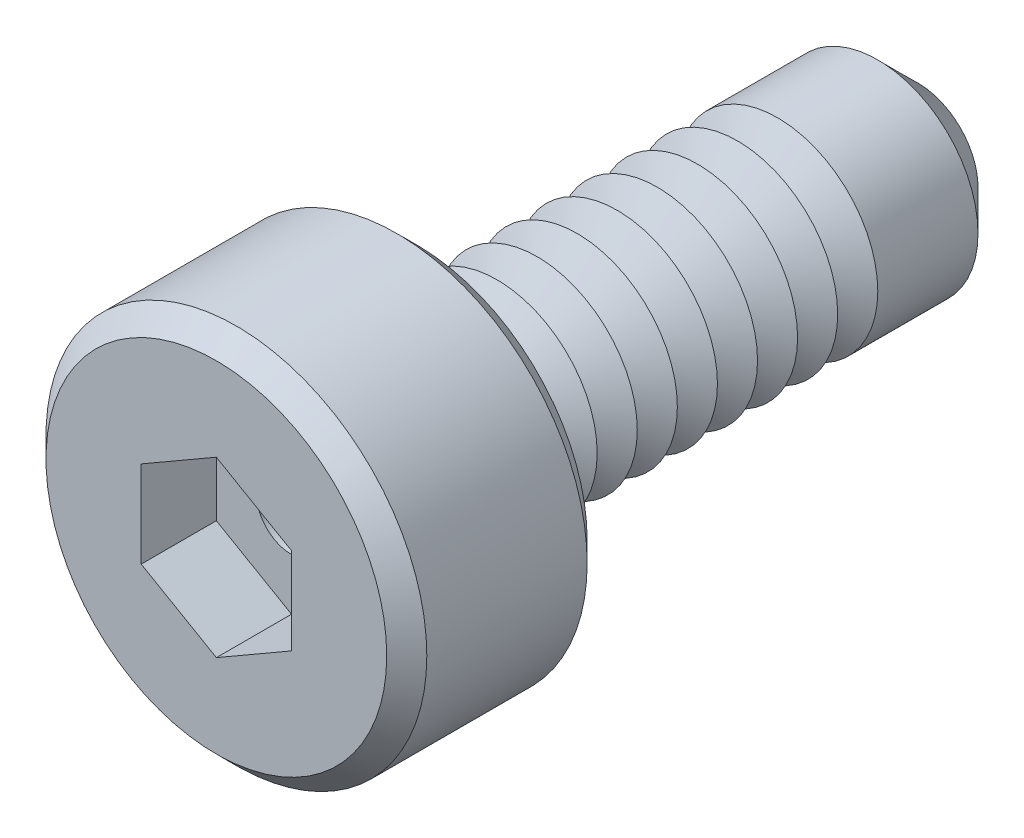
from build123d import *

# Parameters (mm, degrees)
SKETCH1_R           = 1.9
BOSS_EXTRUDE1_DEPTH = 2
SKETCH2_R           = 1
BOSS_EXTRUDE2_DEPTH = 5
CHAMFER1_SIZE       = 0.4
LPATTERN1_COUNT     = 9
LPATTERN1_PITCH     = 0.4
CUT_EXTRUDE1_DEPTH  = 0.75
SKETCH6_R           = 0.35
CUT_EXTRUDE2_DEPTH  = 6.25
CHAMFER2_SIZE       = 0.2


with BuildPart() as part:
    # Sketch1 → Boss-Extrude1 (new body)
    with BuildSketch(Plane.XY):
        Circle(SKETCH1_R)
    extrude(amount=BOSS_EXTRUDE1_DEPTH)

    # Sketch2 → Boss-Extrude2 (add)
    with BuildSketch(Plane(origin=(0, 0, 0), x_dir=(-1, 0, 0), z_dir=(0, 0, -1))):
        Circle(SKETCH2_R)
    extrude(amount=BOSS_EXTRUDE2_DEPTH)

    # Chamfer1
    chamfer1_edges = [part.edges().sort_by_distance(p)[0] for p in [
        (1, 0, -5),
    ]]
    chamfer(chamfer1_edges, length=CHAMFER1_SIZE)

    # Sketch4 → Cut-Revolve1 (revolve, cut)
    with BuildSketch(Plane(origin=(0, 0, 0), x_dir=(0, 0, -1), z_dir=(1, 0, 0)), mode=Mode.PRIVATE) as cut_revolve1_sk:
        Polygon((0, 1), (0.2, 0.653589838), (0.4, 1), align=None)
    cut_revolve1 = revolve(cut_revolve1_sk.sketch.rotate(Axis((0, 0, 2.512122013), (0, 0, -1)), 90), axis=Axis((0, 0, 2.512122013), (0, 0, -1)), mode=Mode.SUBTRACT)

    # LPattern1: Cut-Revolve1 ×9
    with Locations(*[(0, 0, -i * LPATTERN1_PITCH) for i in range(1, LPATTERN1_COUNT)]):
        add(cut_revolve1, mode=Mode.SUBTRACT)

    # Sketch5 → Cut-Extrude1 (cut)
    with BuildSketch(Plane.XY.offset(2)):
        Polygon((0, 0.866025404), (-0.75, 0.433012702), (-0.75, -0.433012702), (0, -0.866025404), (0.75, -0.433012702), (0.75, 0.433012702), align=None)
    extrude(amount=-CUT_EXTRUDE1_DEPTH, mode=Mode.SUBTRACT)

    # Sketch6 → Cut-Extrude2 (cut)
    with BuildSketch(Plane.XY.offset(1.25)):
        Circle(SKETCH6_R)
    extrude(amount=-CUT_EXTRUDE2_DEPTH, mode=Mode.SUBTRACT)

    # Chamfer2
    chamfer2_edges = [part.edges().sort_by_distance(p)[0] for p in [
        (-1.9, 0, 0),
        (-1.9, 0, 2),
    ]]
    chamfer(chamfer2_edges, length=CHAMFER2_SIZE)


solid = part.part
